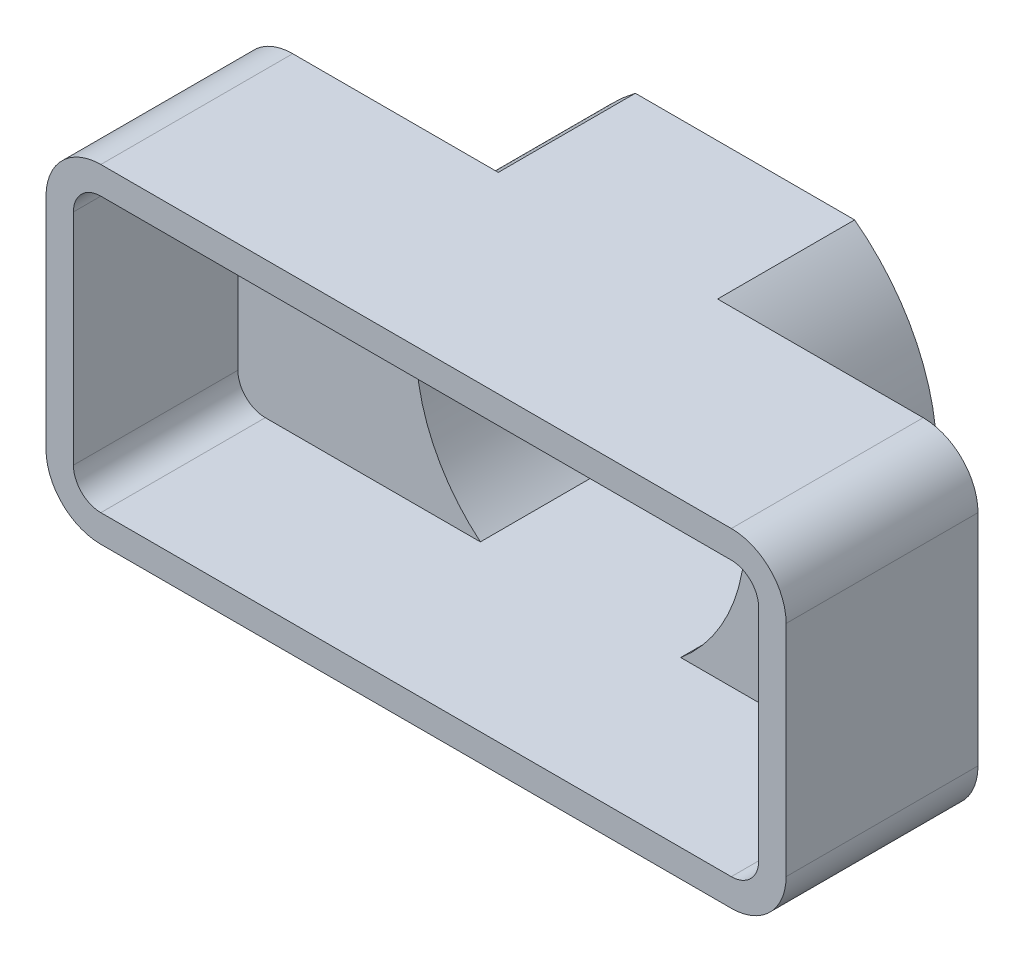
from build123d import *

# Parameters (mm, degrees)
BOSS_EXTRU_1_DEPTH      = 5
ESQUISSE2_R             = 0.5
BOSS_EXTRU_2_DEPTH      = 7
ENL_V_MAT_EXTRU_1_DEPTH = 6
ESQUISSE6_R             = 1
BOSS_EXTRU_3_DEPTH      = 1


with BuildPart() as part:
    # Esquisse1 → Boss.-Extru.1 (new body)
    with BuildSketch(Plane.XY):
        with BuildLine():
            Line((4, 6), (-4, 6))
            ThreePointArc((-4, 6), (-7, 0), (-4, -6))
            Line((-4, -6), (4, -6))
            ThreePointArc((4, -6), (7, 0), (4, 6))
        make_face()
        with BuildLine():
            Line((3.653311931, 5), (-3.653311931, 5))
            ThreePointArc((-3.653311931, 5), (-6, 0), (-3.653311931, -5))
            Line((-3.653311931, -5), (3.653311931, -5))
            ThreePointArc((3.653311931, -5), (6, 0), (3.653311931, 5))
        make_face(mode=Mode.SUBTRACT)
    extrude(amount=BOSS_EXTRU_1_DEPTH)

    # Esquisse2 → Boss.-Extru.2 (add)
    with BuildSketch(Plane.XY.offset(5)):
        with BuildLine():
            Line((-11.5, -6), (11.5, -6))
            ThreePointArc((11.5, -6), (12.914213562, -5.414213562), (13.5, -4))
            Line((13.5, -4), (13.5, 4))
            ThreePointArc((13.5, 4), (12.914213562, 5.414213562), (11.5, 6))
            Line((11.5, 6), (-11.5, 6))
            ThreePointArc((-11.5, 6), (-12.914213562, 5.414213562), (-13.5, 4))
            Line((-13.5, 4), (-13.5, -4))
            ThreePointArc((-13.5, -4), (-12.914213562, -5.414213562), (-11.5, -6))
        make_face()
        with Locations((-11.5, 0)):
            Circle(ESQUISSE2_R, mode=Mode.SUBTRACT)
        with BuildLine():
            Line((-3.653311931, 5), (3.653311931, 5))
            ThreePointArc((3.653311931, 5), (6, 0), (3.653311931, -5))
            Line((3.653311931, -5), (-3.653311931, -5))
            ThreePointArc((-3.653311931, -5), (-6, 0), (-3.653311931, 5))
        make_face(mode=Mode.SUBTRACT)
    extrude(amount=BOSS_EXTRU_2_DEPTH)

    # Esquisse3 → Enl_v. mat.-Extru.1 (cut)
    with BuildSketch(Plane.XY.offset(12)):
        with BuildLine():
            Line((-11.5, -5), (11.5, -5))
            ThreePointArc((11.5, -5), (12.207106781, -4.707106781), (12.5, -4))
            Line((12.5, -4), (12.5, 4))
            ThreePointArc((12.5, 4), (12.207106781, 4.707106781), (11.5, 5))
            Line((11.5, 5), (-11.5, 5))
            ThreePointArc((-11.5, 5), (-12.207106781, 4.707106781), (-12.5, 4))
            Line((-12.5, 4), (-12.5, -4))
            ThreePointArc((-12.5, -4), (-12.207106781, -4.707106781), (-11.5, -5))
        make_face()
    extrude(amount=-ENL_V_MAT_EXTRU_1_DEPTH, mode=Mode.SUBTRACT)

    # Esquisse6 → Boss.-Extru.3 (add)
    with BuildSketch(Plane(origin=(0, 0, 0), x_dir=(-1, 0, 0), z_dir=(0, 0, -1))):
        with BuildLine():
            Line((-4, 6), (4, 6))
            ThreePointArc((4, 6), (7, 0), (4, -6))
            Line((4, -6), (-4, -6))
            ThreePointArc((-4, -6), (-7, 0), (-4, 6))
        make_face()
        Circle(ESQUISSE6_R, mode=Mode.SUBTRACT)
    extrude(amount=-BOSS_EXTRU_3_DEPTH)


solid = part.part
